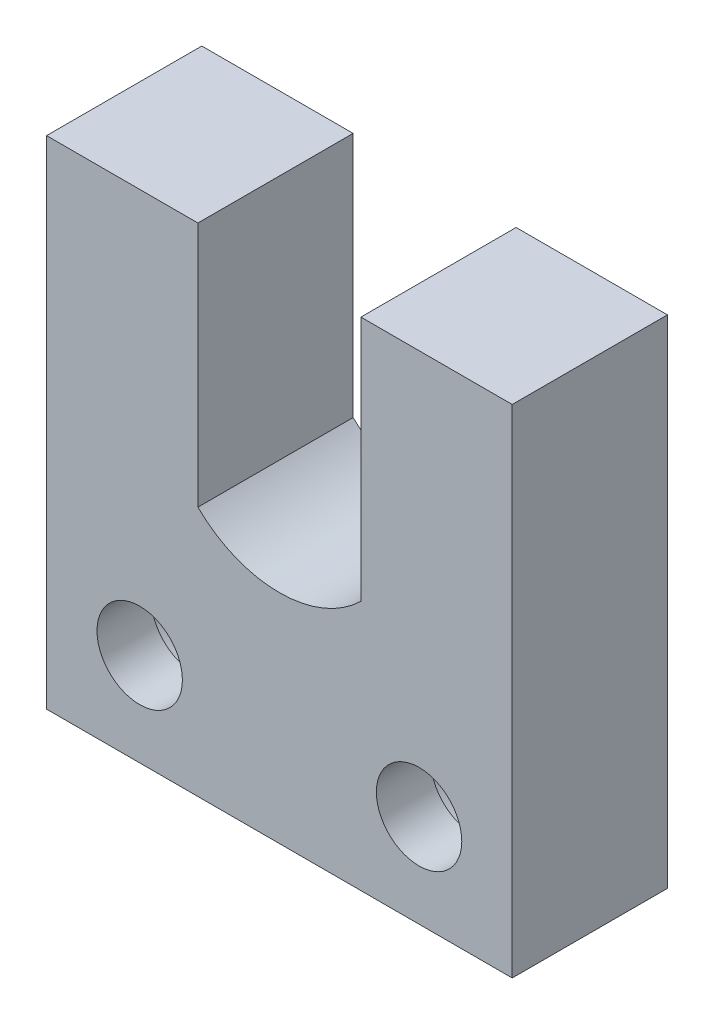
from build123d import *

# Parameters (mm, degrees)
SKETCH_1_R          = 2.75
EXTRUDE_1_DEPTH     = 10
SKETCH_3_R          = 4.75
CUT_EXTRUDE_1_DEPTH = 6.5


with BuildPart() as part:
    # Sketch 1 → Extrude 1 (new body)
    with BuildSketch(Plane.XY):
        with BuildLine():
            Line((0, 0), (0, 32))
            Line((0, 32), (9.75, 32))
            Line((9.75, 32), (9.75, 16.143928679))
            ThreePointArc((9.75, 16.143928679), (15, 14), (20.25, 16.143928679))
            Line((20.25, 16.143928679), (20.25, 32))
            Line((20.25, 32), (30, 32))
            Line((30, 32), (30, 0))
            Line((30, 0), (0, 0))
        make_face()
        with Locations((24, 6)):
            Circle(SKETCH_1_R, mode=Mode.SUBTRACT)
        with Locations((6, 6)):
            Circle(SKETCH_1_R, mode=Mode.SUBTRACT)
    extrude(amount=EXTRUDE_1_DEPTH)

    # Sketch 3 → Cut-Extrude 1 (cut)
    with BuildSketch(Plane(origin=(0, 0, 0), x_dir=(-1, 0, 0), z_dir=(0, 0, -1))):
        with Locations((-24, 6)):
            Circle(SKETCH_3_R)
        with Locations((-6, 6)):
            Circle(SKETCH_3_R)
    extrude(amount=-CUT_EXTRUDE_1_DEPTH, mode=Mode.SUBTRACT)


solid = part.part
